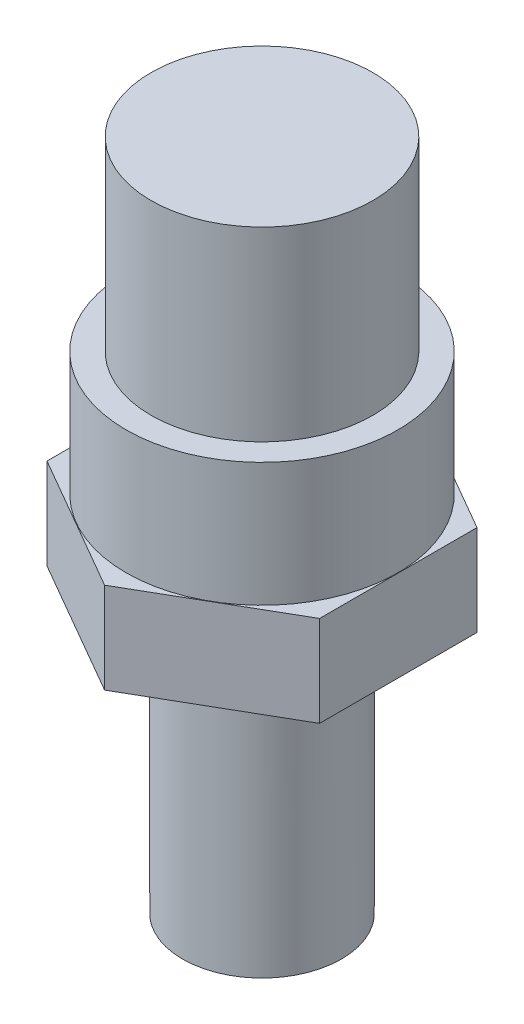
ISO-10303-21;
HEADER;
FILE_DESCRIPTION(('STEP AP214'),'2;1');
FILE_NAME('part.step','',(''),(''),'','','');
FILE_SCHEMA(('AUTOMOTIVE_DESIGN { 1 0 10303 214 1 1 1 1 }'));
ENDSEC;
DATA;
#1=APPLICATION_CONTEXT('core data for automotive mechanical design processes');
#2=APPLICATION_PROTOCOL_DEFINITION('international standard','automotive_design',2000,#1);
#3=PRODUCT_CONTEXT('',#1,'mechanical');
#4=PRODUCT('Part','Part','',(#3));
#5=PRODUCT_RELATED_PRODUCT_CATEGORY('part','',(#4));
#6=PRODUCT_DEFINITION_FORMATION('','',#4);
#7=PRODUCT_DEFINITION_CONTEXT('part definition',#1,'design');
#8=PRODUCT_DEFINITION('design','',#6,#7);
#9=PRODUCT_DEFINITION_SHAPE('','',#8);
#10=(LENGTH_UNIT() NAMED_UNIT(*) SI_UNIT(.MILLI.,.METRE.));
#11=(NAMED_UNIT(*) PLANE_ANGLE_UNIT() SI_UNIT($,.RADIAN.));
#12=(NAMED_UNIT(*) SI_UNIT($,.STERADIAN.) SOLID_ANGLE_UNIT());
#13=UNCERTAINTY_MEASURE_WITH_UNIT(LENGTH_MEASURE(1.E-05),#10,'distance_accuracy_value','');
#14=(GEOMETRIC_REPRESENTATION_CONTEXT(3) GLOBAL_UNCERTAINTY_ASSIGNED_CONTEXT((#13)) GLOBAL_UNIT_ASSIGNED_CONTEXT((#10,
#11,#12)) REPRESENTATION_CONTEXT('',''));
#15=CARTESIAN_POINT('',(0.,0.,0.));
#16=DIRECTION('',(0.,0.,1.));
#17=DIRECTION('',(1.,0.,0.));
#18=AXIS2_PLACEMENT_3D('',#15,#16,#17);
#19=CARTESIAN_POINT('',(9.525,28.,-5.49926131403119));
#20=DIRECTION('',(-0.5,0.,0.866025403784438));
#21=DIRECTION('',(0.866025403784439,0.,0.5));
#22=AXIS2_PLACEMENT_3D('',#19,#20,#21);
#23=PLANE('',#22);
#24=DIRECTION('',(-0.866025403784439,0.,-0.5));
#25=VECTOR('',#24,1.);
#26=CARTESIAN_POINT('',(9.525,6.35,-5.49926131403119));
#27=LINE('',#26,#25);
#28=CARTESIAN_POINT('',(9.525,6.35,-5.49926131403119));
#29=VERTEX_POINT('',#28);
#30=CARTESIAN_POINT('',(0.,6.35,-10.9985226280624));
#31=VERTEX_POINT('',#30);
#32=EDGE_CURVE('E85',#29,#31,#27,.T.);
#33=ORIENTED_EDGE('',*,*,#32,.F.);
#34=DIRECTION('',(0.,-1.,0.));
#35=VECTOR('',#34,1.);
#36=CARTESIAN_POINT('',(9.525,28.,-5.49926131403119));
#37=LINE('',#36,#35);
#38=CARTESIAN_POINT('',(9.525,0.,-5.49926131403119));
#39=VERTEX_POINT('',#38);
#40=EDGE_CURVE('E55',#29,#39,#37,.T.);
#41=ORIENTED_EDGE('',*,*,#40,.T.);
#42=DIRECTION('',(-0.866025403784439,0.,-0.5));
#43=VECTOR('',#42,1.);
#44=CARTESIAN_POINT('',(9.525,0.,-5.49926131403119));
#45=LINE('',#44,#43);
#46=CARTESIAN_POINT('',(0.,0.,-10.9985226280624));
#47=VERTEX_POINT('',#46);
#48=EDGE_CURVE('E137',#39,#47,#45,.T.);
#49=ORIENTED_EDGE('',*,*,#48,.T.);
#50=DIRECTION('',(0.,-1.,0.));
#51=VECTOR('',#50,1.);
#52=CARTESIAN_POINT('',(0.,28.,-10.9985226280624));
#53=LINE('',#52,#51);
#54=EDGE_CURVE('E90',#31,#47,#53,.T.);
#55=ORIENTED_EDGE('',*,*,#54,.F.);
#56=EDGE_LOOP('',(#33,#41,#49,#55));
#57=FACE_BOUND('',#56,.T.);
#58=ADVANCED_FACE('F34',(#57),#23,.F.);
#59=CARTESIAN_POINT('',(0.,28.,-10.9985226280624));
#60=DIRECTION('',(0.5,0.,0.866025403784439));
#61=DIRECTION('',(0.866025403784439,0.,-0.5));
#62=AXIS2_PLACEMENT_3D('',#59,#60,#61);
#63=PLANE('',#62);
#64=DIRECTION('',(-0.866025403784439,0.,0.5));
#65=VECTOR('',#64,1.);
#66=CARTESIAN_POINT('',(0.,6.35,-10.9985226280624));
#67=LINE('',#66,#65);
#68=CARTESIAN_POINT('',(-9.52500000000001,6.35,-5.49926131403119));
#69=VERTEX_POINT('',#68);
#70=EDGE_CURVE('E92',#31,#69,#67,.T.);
#71=ORIENTED_EDGE('',*,*,#70,.F.);
#72=ORIENTED_EDGE('',*,*,#54,.T.);
#73=DIRECTION('',(-0.866025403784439,0.,0.5));
#74=VECTOR('',#73,1.);
#75=CARTESIAN_POINT('',(0.,0.,-10.9985226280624));
#76=LINE('',#75,#74);
#77=CARTESIAN_POINT('',(-9.52500000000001,0.,-5.49926131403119));
#78=VERTEX_POINT('',#77);
#79=EDGE_CURVE('E139',#47,#78,#76,.T.);
#80=ORIENTED_EDGE('',*,*,#79,.T.);
#81=DIRECTION('',(0.,-1.,0.));
#82=VECTOR('',#81,1.);
#83=CARTESIAN_POINT('',(-9.52500000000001,28.,-5.49926131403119));
#84=LINE('',#83,#82);
#85=EDGE_CURVE('E109',#69,#78,#84,.T.);
#86=ORIENTED_EDGE('',*,*,#85,.F.);
#87=EDGE_LOOP('',(#71,#72,#80,#86));
#88=FACE_BOUND('',#87,.T.);
#89=ADVANCED_FACE('F160',(#88),#63,.F.);
#90=CARTESIAN_POINT('',(-9.52500000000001,28.,-5.49926131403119));
#91=DIRECTION('',(1.,0.,0.));
#92=DIRECTION('',(0.,0.,-1.));
#93=AXIS2_PLACEMENT_3D('',#90,#91,#92);
#94=PLANE('',#93);
#95=DIRECTION('',(0.,0.,1.));
#96=VECTOR('',#95,1.);
#97=CARTESIAN_POINT('',(-9.52500000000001,6.35,-5.49926131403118));
#98=LINE('',#97,#96);
#99=CARTESIAN_POINT('',(-9.52500000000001,6.35,5.49926131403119));
#100=VERTEX_POINT('',#99);
#101=EDGE_CURVE('E126',#69,#100,#98,.T.);
#102=ORIENTED_EDGE('',*,*,#101,.F.);
#103=ORIENTED_EDGE('',*,*,#85,.T.);
#104=DIRECTION('',(0.,0.,1.));
#105=VECTOR('',#104,1.);
#106=CARTESIAN_POINT('',(-9.52500000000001,0.,-5.49926131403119));
#107=LINE('',#106,#105);
#108=CARTESIAN_POINT('',(-9.52500000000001,0.,5.49926131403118));
#109=VERTEX_POINT('',#108);
#110=EDGE_CURVE('E142',#78,#109,#107,.T.);
#111=ORIENTED_EDGE('',*,*,#110,.T.);
#112=DIRECTION('',(0.,-1.,0.));
#113=VECTOR('',#112,1.);
#114=CARTESIAN_POINT('',(-9.52500000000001,28.,5.49926131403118));
#115=LINE('',#114,#113);
#116=EDGE_CURVE('E107',#100,#109,#115,.T.);
#117=ORIENTED_EDGE('',*,*,#116,.F.);
#118=EDGE_LOOP('',(#102,#103,#111,#117));
#119=FACE_BOUND('',#118,.T.);
#120=ADVANCED_FACE('F165',(#119),#94,.F.);
#121=CARTESIAN_POINT('',(-9.52500000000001,28.,5.49926131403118));
#122=DIRECTION('',(0.5,0.,-0.866025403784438));
#123=DIRECTION('',(-0.866025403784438,0.,-0.5));
#124=AXIS2_PLACEMENT_3D('',#121,#122,#123);
#125=PLANE('',#124);
#126=DIRECTION('',(0.866025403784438,0.,0.5));
#127=VECTOR('',#126,1.);
#128=CARTESIAN_POINT('',(-9.525,6.35,5.49926131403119));
#129=LINE('',#128,#127);
#130=CARTESIAN_POINT('',(0.,6.35000000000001,10.9985226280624));
#131=VERTEX_POINT('',#130);
#132=EDGE_CURVE('E118',#100,#131,#129,.T.);
#133=ORIENTED_EDGE('',*,*,#132,.F.);
#134=ORIENTED_EDGE('',*,*,#116,.T.);
#135=DIRECTION('',(0.866025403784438,0.,0.5));
#136=VECTOR('',#135,1.);
#137=CARTESIAN_POINT('',(-9.52500000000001,0.,5.49926131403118));
#138=LINE('',#137,#136);
#139=CARTESIAN_POINT('',(0.,0.,10.9985226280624));
#140=VERTEX_POINT('',#139);
#141=EDGE_CURVE('E145',#109,#140,#138,.T.);
#142=ORIENTED_EDGE('',*,*,#141,.T.);
#143=DIRECTION('',(0.,-1.,0.));
#144=VECTOR('',#143,1.);
#145=CARTESIAN_POINT('',(0.,28.,10.9985226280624));
#146=LINE('',#145,#144);
#147=EDGE_CURVE('E100',#131,#140,#146,.T.);
#148=ORIENTED_EDGE('',*,*,#147,.F.);
#149=EDGE_LOOP('',(#133,#134,#142,#148));
#150=FACE_BOUND('',#149,.T.);
#151=ADVANCED_FACE('F167',(#150),#125,.F.);
#152=CARTESIAN_POINT('',(0.,28.,10.9985226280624));
#153=DIRECTION('',(-0.5,0.,-0.866025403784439));
#154=DIRECTION('',(-0.866025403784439,0.,0.5));
#155=AXIS2_PLACEMENT_3D('',#152,#153,#154);
#156=PLANE('',#155);
#157=DIRECTION('',(0.866025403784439,0.,-0.5));
#158=VECTOR('',#157,1.);
#159=CARTESIAN_POINT('',(0.,6.35000000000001,10.9985226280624));
#160=LINE('',#159,#158);
#161=CARTESIAN_POINT('',(9.525,6.35,5.49926131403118));
#162=VERTEX_POINT('',#161);
#163=EDGE_CURVE('E47',#131,#162,#160,.T.);
#164=ORIENTED_EDGE('',*,*,#163,.F.);
#165=ORIENTED_EDGE('',*,*,#147,.T.);
#166=DIRECTION('',(0.866025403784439,0.,-0.5));
#167=VECTOR('',#166,1.);
#168=CARTESIAN_POINT('',(0.,0.,10.9985226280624));
#169=LINE('',#168,#167);
#170=CARTESIAN_POINT('',(9.525,0.,5.49926131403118));
#171=VERTEX_POINT('',#170);
#172=EDGE_CURVE('E102',#140,#171,#169,.T.);
#173=ORIENTED_EDGE('',*,*,#172,.T.);
#174=DIRECTION('',(0.,-1.,0.));
#175=VECTOR('',#174,1.);
#176=CARTESIAN_POINT('',(9.525,28.,5.49926131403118));
#177=LINE('',#176,#175);
#178=EDGE_CURVE('E98',#162,#171,#177,.T.);
#179=ORIENTED_EDGE('',*,*,#178,.F.);
#180=EDGE_LOOP('',(#164,#165,#173,#179));
#181=FACE_BOUND('',#180,.T.);
#182=ADVANCED_FACE('F150',(#181),#156,.F.);
#183=CARTESIAN_POINT('',(9.525,28.,5.49926131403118));
#184=DIRECTION('',(-1.,0.,0.));
#185=DIRECTION('',(0.,0.,1.));
#186=AXIS2_PLACEMENT_3D('',#183,#184,#185);
#187=PLANE('',#186);
#188=DIRECTION('',(0.,0.,-1.));
#189=VECTOR('',#188,1.);
#190=CARTESIAN_POINT('',(9.525,6.35,5.49926131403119));
#191=LINE('',#190,#189);
#192=EDGE_CURVE('E11',#162,#29,#191,.T.);
#193=ORIENTED_EDGE('',*,*,#192,.F.);
#194=ORIENTED_EDGE('',*,*,#178,.T.);
#195=DIRECTION('',(0.,0.,-1.));
#196=VECTOR('',#195,1.);
#197=CARTESIAN_POINT('',(9.525,0.,5.49926131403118));
#198=LINE('',#197,#196);
#199=EDGE_CURVE('E96',#171,#39,#198,.T.);
#200=ORIENTED_EDGE('',*,*,#199,.T.);
#201=ORIENTED_EDGE('',*,*,#40,.F.);
#202=EDGE_LOOP('',(#193,#194,#200,#201));
#203=FACE_BOUND('',#202,.T.);
#204=ADVANCED_FACE('F94',(#203),#187,.F.);
#205=CARTESIAN_POINT('',(0.,0.,-10.9985226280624));
#206=DIRECTION('',(0.,1.,0.));
#207=DIRECTION('',(0.,0.,1.));
#208=AXIS2_PLACEMENT_3D('',#205,#206,#207);
#209=PLANE('',#208);
#210=ORIENTED_EDGE('',*,*,#48,.F.);
#211=ORIENTED_EDGE('',*,*,#199,.F.);
#212=ORIENTED_EDGE('',*,*,#172,.F.);
#213=ORIENTED_EDGE('',*,*,#141,.F.);
#214=ORIENTED_EDGE('',*,*,#110,.F.);
#215=ORIENTED_EDGE('',*,*,#79,.F.);
#216=EDGE_LOOP('',(#210,#211,#212,#213,#214,#215));
#217=FACE_BOUND('',#216,.T.);
#218=CARTESIAN_POINT('',(0.,0.,0.));
#219=DIRECTION('',(0.,1.,0.));
#220=DIRECTION('',(0.,0.,1.));
#221=AXIS2_PLACEMENT_3D('',#218,#219,#220);
#222=CIRCLE('',#221,5.55625);
#223=CARTESIAN_POINT('',(0.,0.,5.55625));
#224=VERTEX_POINT('',#223);
#225=EDGE_CURVE('E41',#224,#224,#222,.F.);
#226=ORIENTED_EDGE('',*,*,#225,.F.);
#227=EDGE_LOOP('',(#226));
#228=FACE_BOUND('',#227,.T.);
#229=ADVANCED_FACE('F154',(#217,#228),#209,.F.);
#230=CARTESIAN_POINT('',(0.,-19.,0.));
#231=DIRECTION('',(0.,1.,0.));
#232=DIRECTION('',(0.,0.,1.));
#233=AXIS2_PLACEMENT_3D('',#230,#231,#232);
#234=CYLINDRICAL_SURFACE('',#233,5.55625);
#235=CARTESIAN_POINT('',(0.,-19.,0.));
#236=DIRECTION('',(0.,-1.,0.));
#237=DIRECTION('',(0.,0.,-1.));
#238=AXIS2_PLACEMENT_3D('',#235,#236,#237);
#239=CIRCLE('',#238,5.55625);
#240=CARTESIAN_POINT('',(0.,-19.,-5.55625));
#241=VERTEX_POINT('',#240);
#242=EDGE_CURVE('E134',#241,#241,#239,.T.);
#243=ORIENTED_EDGE('',*,*,#242,.F.);
#244=EDGE_LOOP('',(#243));
#245=FACE_BOUND('',#244,.T.);
#246=ORIENTED_EDGE('',*,*,#225,.T.);
#247=EDGE_LOOP('',(#246));
#248=FACE_BOUND('',#247,.T.);
#249=ADVANCED_FACE('F225',(#245,#248),#234,.T.);
#250=CARTESIAN_POINT('',(0.,-19.,0.));
#251=DIRECTION('',(0.,-1.,0.));
#252=DIRECTION('',(0.,0.,-1.));
#253=AXIS2_PLACEMENT_3D('',#250,#251,#252);
#254=PLANE('',#253);
#255=ORIENTED_EDGE('',*,*,#242,.T.);
#256=EDGE_LOOP('',(#255));
#257=FACE_BOUND('',#256,.T.);
#258=ADVANCED_FACE('F196',(#257),#254,.T.);
#259=CARTESIAN_POINT('',(0.,6.35,-9.5));
#260=DIRECTION('',(0.,1.,0.));
#261=DIRECTION('',(0.,0.,1.));
#262=AXIS2_PLACEMENT_3D('',#259,#260,#261);
#263=PLANE('',#262);
#264=CARTESIAN_POINT('',(0.,6.35,0.));
#265=DIRECTION('',(0.,1.,0.));
#266=DIRECTION('',(0.,0.,1.));
#267=AXIS2_PLACEMENT_3D('',#264,#265,#266);
#268=CIRCLE('',#267,9.5);
#269=CARTESIAN_POINT('',(0.,6.35000000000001,9.5));
#270=VERTEX_POINT('',#269);
#271=EDGE_CURVE('E115',#270,#270,#268,.T.);
#272=ORIENTED_EDGE('',*,*,#271,.F.);
#273=EDGE_LOOP('',(#272));
#274=FACE_BOUND('',#273,.T.);
#275=ORIENTED_EDGE('',*,*,#32,.T.);
#276=ORIENTED_EDGE('',*,*,#70,.T.);
#277=ORIENTED_EDGE('',*,*,#101,.T.);
#278=ORIENTED_EDGE('',*,*,#132,.T.);
#279=ORIENTED_EDGE('',*,*,#163,.T.);
#280=ORIENTED_EDGE('',*,*,#192,.T.);
#281=EDGE_LOOP('',(#275,#276,#277,#278,#279,#280));
#282=FACE_BOUND('',#281,.T.);
#283=ADVANCED_FACE('F84',(#274,#282),#263,.T.);
#284=CARTESIAN_POINT('',(0.,28.,0.));
#285=DIRECTION('',(0.,1.,0.));
#286=DIRECTION('',(0.,0.,1.));
#287=AXIS2_PLACEMENT_3D('',#284,#285,#286);
#288=CYLINDRICAL_SURFACE('',#287,9.5);
#289=CARTESIAN_POINT('',(0.,15.,0.));
#290=DIRECTION('',(0.,1.,0.));
#291=DIRECTION('',(0.,0.,1.));
#292=AXIS2_PLACEMENT_3D('',#289,#290,#291);
#293=CIRCLE('',#292,9.5);
#294=CARTESIAN_POINT('',(0.,15.,9.5));
#295=VERTEX_POINT('',#294);
#296=EDGE_CURVE('E113',#295,#295,#293,.T.);
#297=ORIENTED_EDGE('',*,*,#296,.F.);
#298=EDGE_LOOP('',(#297));
#299=FACE_BOUND('',#298,.T.);
#300=ORIENTED_EDGE('',*,*,#271,.T.);
#301=EDGE_LOOP('',(#300));
#302=FACE_BOUND('',#301,.T.);
#303=ADVANCED_FACE('F195',(#299,#302),#288,.T.);
#304=CARTESIAN_POINT('',(0.,28.,-10.9985226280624));
#305=DIRECTION('',(0.,1.,0.));
#306=DIRECTION('',(0.,0.,1.));
#307=AXIS2_PLACEMENT_3D('',#304,#305,#306);
#308=PLANE('',#307);
#309=CARTESIAN_POINT('',(0.,28.,0.));
#310=DIRECTION('',(0.,1.,0.));
#311=DIRECTION('',(0.,0.,1.));
#312=AXIS2_PLACEMENT_3D('',#309,#310,#311);
#313=CIRCLE('',#312,7.74999999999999);
#314=CARTESIAN_POINT('',(0.,28.,7.74999999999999));
#315=VERTEX_POINT('',#314);
#316=EDGE_CURVE('E91',#315,#315,#313,.T.);
#317=ORIENTED_EDGE('',*,*,#316,.T.);
#318=EDGE_LOOP('',(#317));
#319=FACE_BOUND('',#318,.T.);
#320=ADVANCED_FACE('F251',(#319),#308,.T.);
#321=CARTESIAN_POINT('',(0.,28.,0.));
#322=DIRECTION('',(0.,1.,0.));
#323=DIRECTION('',(0.,0.,1.));
#324=AXIS2_PLACEMENT_3D('',#321,#322,#323);
#325=CYLINDRICAL_SURFACE('',#324,7.75);
#326=CARTESIAN_POINT('',(0.,15.,0.));
#327=DIRECTION('',(0.,1.,0.));
#328=DIRECTION('',(0.,0.,1.));
#329=AXIS2_PLACEMENT_3D('',#326,#327,#328);
#330=CIRCLE('',#329,7.75);
#331=CARTESIAN_POINT('',(0.,15.,7.75));
#332=VERTEX_POINT('',#331);
#333=EDGE_CURVE('E131',#332,#332,#330,.T.);
#334=ORIENTED_EDGE('',*,*,#333,.T.);
#335=EDGE_LOOP('',(#334));
#336=FACE_BOUND('',#335,.T.);
#337=ORIENTED_EDGE('',*,*,#316,.F.);
#338=EDGE_LOOP('',(#337));
#339=FACE_BOUND('',#338,.T.);
#340=ADVANCED_FACE('F245',(#336,#339),#325,.T.);
#341=CARTESIAN_POINT('',(0.,15.,-7.75));
#342=DIRECTION('',(0.,1.,0.));
#343=DIRECTION('',(0.,0.,1.));
#344=AXIS2_PLACEMENT_3D('',#341,#342,#343);
#345=PLANE('',#344);
#346=ORIENTED_EDGE('',*,*,#333,.F.);
#347=EDGE_LOOP('',(#346));
#348=FACE_BOUND('',#347,.T.);
#349=ORIENTED_EDGE('',*,*,#296,.T.);
#350=EDGE_LOOP('',(#349));
#351=FACE_BOUND('',#350,.T.);
#352=ADVANCED_FACE('F250',(#348,#351),#345,.T.);
#353=CLOSED_SHELL('',(#58,#89,#120,#151,#182,#204,#229,#249,#258,#283,#303,#320,#340,#352));
#354=MANIFOLD_SOLID_BREP('B2',#353);
#355=ADVANCED_BREP_SHAPE_REPRESENTATION('',(#18,#354),#14);
#356=SHAPE_DEFINITION_REPRESENTATION(#9,#355);
ENDSEC;
END-ISO-10303-21;
